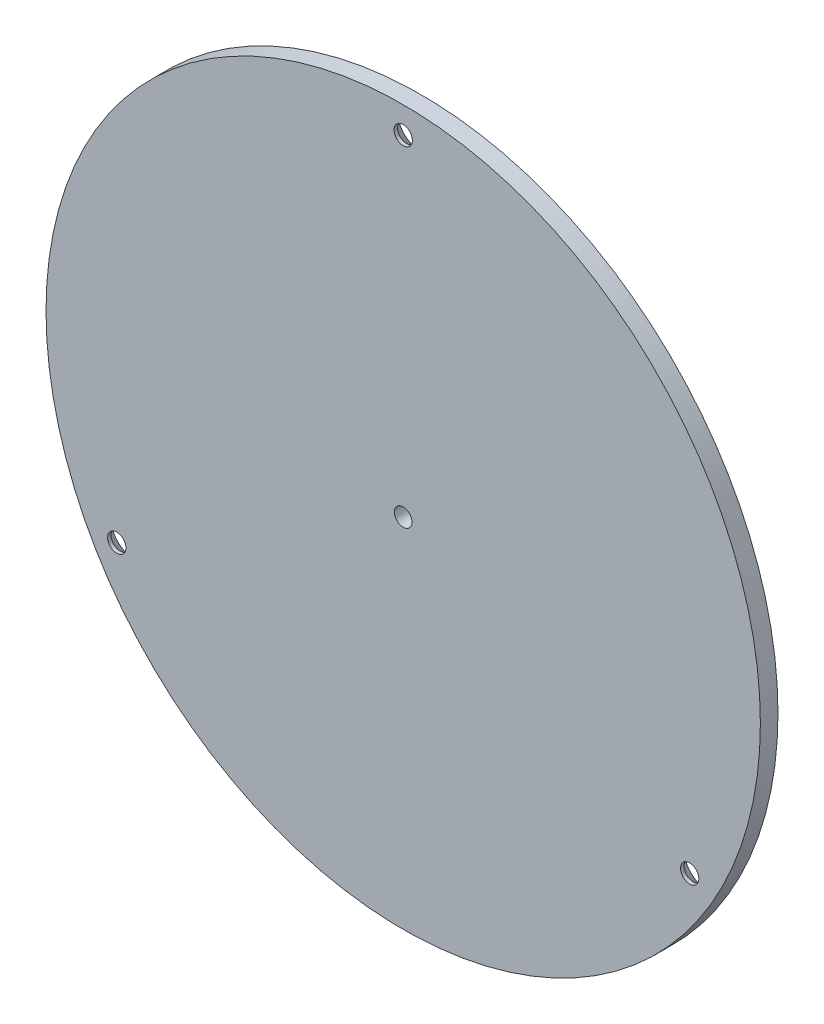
from build123d import *

# Parameters (mm, degrees)
SZKIC1_R                    = 101.5
DODANIE_WYCI_GNI_CIE1_DEPTH = 5
SZKIC2_R                    = 2.5
SZKIC2_R_2                  = 2.6
WYTNIJ_WYCI_GNI_CIE1_DEPTH  = 144.629732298
SFAZOWANIE1_SIZE            = 4


with BuildPart() as part:
    # Szkic1 → Dodanie-wyci_gni_cie1 (new body)
    with BuildSketch(Plane.XY):
        Circle(SZKIC1_R)
    extrude(amount=DODANIE_WYCI_GNI_CIE1_DEPTH)

    # Szkic2 → Wytnij-wyci_gni_cie1 (cut, through all)
    with BuildSketch(Plane.XY.offset(5)):
        Circle(SZKIC2_R)
        with Locations((0, 94)):
            Circle(SZKIC2_R_2)
        with Locations((81.406387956, -47)):
            Circle(SZKIC2_R_2)
        with Locations((-81.406387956, -47)):
            Circle(SZKIC2_R_2)
    extrude(amount=-WYTNIJ_WYCI_GNI_CIE1_DEPTH, mode=Mode.SUBTRACT)

    # Sfazowanie1
    sfazowanie1_edges = [part.edges().sort_by_distance(p)[0] for p in [
        (-84.006387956, -47, 0),
        (78.806387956, -47, 0),
        (-2.6, 94, 0),
    ]]
    chamfer(sfazowanie1_edges, length=SFAZOWANIE1_SIZE)


solid = part.part
